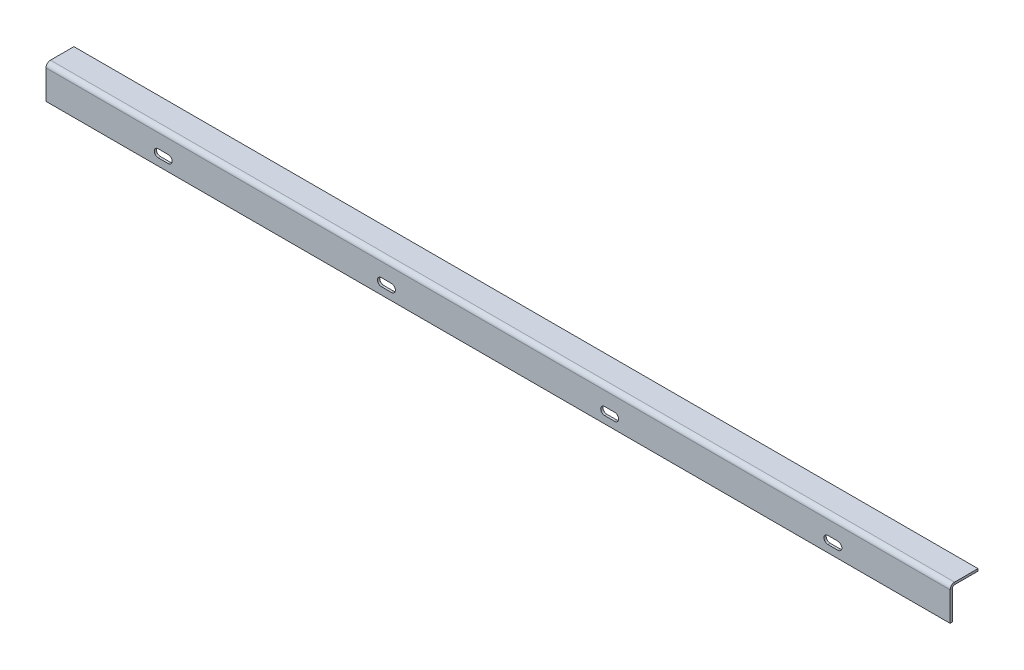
ISO-10303-21;
HEADER;
FILE_DESCRIPTION(('STEP AP214'),'2;1');
FILE_NAME('part.step','',(''),(''),'','','');
FILE_SCHEMA(('AUTOMOTIVE_DESIGN { 1 0 10303 214 1 1 1 1 }'));
ENDSEC;
DATA;
#1=APPLICATION_CONTEXT('core data for automotive mechanical design processes');
#2=APPLICATION_PROTOCOL_DEFINITION('international standard','automotive_design',2000,#1);
#3=PRODUCT_CONTEXT('',#1,'mechanical');
#4=PRODUCT('Part','Part','',(#3));
#5=PRODUCT_RELATED_PRODUCT_CATEGORY('part','',(#4));
#6=PRODUCT_DEFINITION_FORMATION('','',#4);
#7=PRODUCT_DEFINITION_CONTEXT('part definition',#1,'design');
#8=PRODUCT_DEFINITION('design','',#6,#7);
#9=PRODUCT_DEFINITION_SHAPE('','',#8);
#10=(LENGTH_UNIT() NAMED_UNIT(*) SI_UNIT(.MILLI.,.METRE.));
#11=(NAMED_UNIT(*) PLANE_ANGLE_UNIT() SI_UNIT($,.RADIAN.));
#12=(NAMED_UNIT(*) SI_UNIT($,.STERADIAN.) SOLID_ANGLE_UNIT());
#13=UNCERTAINTY_MEASURE_WITH_UNIT(LENGTH_MEASURE(1.E-05),#10,'distance_accuracy_value','');
#14=(GEOMETRIC_REPRESENTATION_CONTEXT(3) GLOBAL_UNCERTAINTY_ASSIGNED_CONTEXT((#13)) GLOBAL_UNIT_ASSIGNED_CONTEXT((#10,
#11,#12)) REPRESENTATION_CONTEXT('',''));
#15=CARTESIAN_POINT('',(0.,0.,0.));
#16=DIRECTION('',(0.,0.,1.));
#17=DIRECTION('',(1.,0.,0.));
#18=AXIS2_PLACEMENT_3D('',#15,#16,#17);
#19=CARTESIAN_POINT('',(-1401.,-47.,0.));
#20=DIRECTION('',(0.,-1.,0.));
#21=DIRECTION('',(0.,0.,-1.));
#22=AXIS2_PLACEMENT_3D('',#19,#20,#21);
#23=PLANE('',#22);
#24=DIRECTION('',(-1.,0.,0.));
#25=VECTOR('',#24,1.);
#26=CARTESIAN_POINT('',(-1401.,-47.,-4.00000000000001));
#27=LINE('',#26,#25);
#28=CARTESIAN_POINT('',(-1401.,-47.,-4.00000000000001));
#29=VERTEX_POINT('',#28);
#30=CARTESIAN_POINT('',(-1419.,-47.,-4.00000000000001));
#31=VERTEX_POINT('',#30);
#32=EDGE_CURVE('E385',#29,#31,#27,.T.);
#33=ORIENTED_EDGE('',*,*,#32,.T.);
#34=DIRECTION('',(0.,0.,-1.));
#35=VECTOR('',#34,1.);
#36=CARTESIAN_POINT('',(-1419.,-47.,0.));
#37=LINE('',#36,#35);
#38=CARTESIAN_POINT('',(-1419.,-47.,0.));
#39=VERTEX_POINT('',#38);
#40=EDGE_CURVE('E11',#39,#31,#37,.T.);
#41=ORIENTED_EDGE('',*,*,#40,.F.);
#42=DIRECTION('',(-1.,0.,0.));
#43=VECTOR('',#42,1.);
#44=CARTESIAN_POINT('',(-1401.,-47.,0.));
#45=LINE('',#44,#43);
#46=CARTESIAN_POINT('',(-1401.,-47.,0.));
#47=VERTEX_POINT('',#46);
#48=EDGE_CURVE('E389',#47,#39,#45,.T.);
#49=ORIENTED_EDGE('',*,*,#48,.F.);
#50=DIRECTION('',(0.,0.,-1.));
#51=VECTOR('',#50,1.);
#52=CARTESIAN_POINT('',(-1401.,-47.,0.));
#53=LINE('',#52,#51);
#54=EDGE_CURVE('E394',#47,#29,#53,.T.);
#55=ORIENTED_EDGE('',*,*,#54,.T.);
#56=EDGE_LOOP('',(#33,#41,#49,#55));
#57=FACE_BOUND('',#56,.T.);
#58=ADVANCED_FACE('F37',(#57),#23,.F.);
#59=CARTESIAN_POINT('',(-1419.,-40.,0.));
#60=DIRECTION('',(0.,0.,-1.));
#61=DIRECTION('',(0.,1.,0.));
#62=AXIS2_PLACEMENT_3D('',#59,#60,#61);
#63=CYLINDRICAL_SURFACE('',#62,7.);
#64=CARTESIAN_POINT('',(-1419.,-40.,-4.00000000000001));
#65=DIRECTION('',(0.,0.,-1.));
#66=DIRECTION('',(0.,1.,0.));
#67=AXIS2_PLACEMENT_3D('',#64,#65,#66);
#68=CIRCLE('',#67,7.);
#69=CARTESIAN_POINT('',(-1419.,-33.,-4.));
#70=VERTEX_POINT('',#69);
#71=EDGE_CURVE('E382',#31,#70,#68,.T.);
#72=ORIENTED_EDGE('',*,*,#71,.T.);
#73=DIRECTION('',(0.,0.,-1.));
#74=VECTOR('',#73,1.);
#75=CARTESIAN_POINT('',(-1419.,-33.,0.));
#76=LINE('',#75,#74);
#77=CARTESIAN_POINT('',(-1419.,-33.,0.));
#78=VERTEX_POINT('',#77);
#79=EDGE_CURVE('E44',#78,#70,#76,.T.);
#80=ORIENTED_EDGE('',*,*,#79,.F.);
#81=CARTESIAN_POINT('',(-1419.,-40.,0.));
#82=DIRECTION('',(0.,0.,-1.));
#83=DIRECTION('',(0.,1.,0.));
#84=AXIS2_PLACEMENT_3D('',#81,#82,#83);
#85=CIRCLE('',#84,7.);
#86=EDGE_CURVE('E58',#39,#78,#85,.T.);
#87=ORIENTED_EDGE('',*,*,#86,.F.);
#88=ORIENTED_EDGE('',*,*,#40,.T.);
#89=EDGE_LOOP('',(#72,#80,#87,#88));
#90=FACE_BOUND('',#89,.T.);
#91=ADVANCED_FACE('F404',(#90),#63,.F.);
#92=CARTESIAN_POINT('',(-1401.,-33.,0.));
#93=DIRECTION('',(0.,1.,0.));
#94=DIRECTION('',(0.,0.,1.));
#95=AXIS2_PLACEMENT_3D('',#92,#93,#94);
#96=PLANE('',#95);
#97=DIRECTION('',(1.,0.,0.));
#98=VECTOR('',#97,1.);
#99=CARTESIAN_POINT('',(-1401.,-33.,-4.));
#100=LINE('',#99,#98);
#101=CARTESIAN_POINT('',(-1401.,-33.,-4.));
#102=VERTEX_POINT('',#101);
#103=EDGE_CURVE('E379',#70,#102,#100,.T.);
#104=ORIENTED_EDGE('',*,*,#103,.T.);
#105=DIRECTION('',(0.,0.,-1.));
#106=VECTOR('',#105,1.);
#107=CARTESIAN_POINT('',(-1401.,-33.,0.));
#108=LINE('',#107,#106);
#109=CARTESIAN_POINT('',(-1401.,-33.,0.));
#110=VERTEX_POINT('',#109);
#111=EDGE_CURVE('E397',#110,#102,#108,.T.);
#112=ORIENTED_EDGE('',*,*,#111,.F.);
#113=DIRECTION('',(1.,0.,0.));
#114=VECTOR('',#113,1.);
#115=CARTESIAN_POINT('',(-1401.,-33.,0.));
#116=LINE('',#115,#114);
#117=EDGE_CURVE('E392',#78,#110,#116,.T.);
#118=ORIENTED_EDGE('',*,*,#117,.F.);
#119=ORIENTED_EDGE('',*,*,#79,.T.);
#120=EDGE_LOOP('',(#104,#112,#118,#119));
#121=FACE_BOUND('',#120,.T.);
#122=ADVANCED_FACE('F401',(#121),#96,.F.);
#123=CARTESIAN_POINT('',(-1401.,-40.,0.));
#124=DIRECTION('',(0.,0.,-1.));
#125=DIRECTION('',(0.,1.,0.));
#126=AXIS2_PLACEMENT_3D('',#123,#124,#125);
#127=CYLINDRICAL_SURFACE('',#126,7.);
#128=CARTESIAN_POINT('',(-1401.,-40.,-4.00000000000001));
#129=DIRECTION('',(0.,0.,-1.));
#130=DIRECTION('',(0.,1.,0.));
#131=AXIS2_PLACEMENT_3D('',#128,#129,#130);
#132=CIRCLE('',#131,7.);
#133=EDGE_CURVE('E377',#102,#29,#132,.T.);
#134=ORIENTED_EDGE('',*,*,#133,.T.);
#135=ORIENTED_EDGE('',*,*,#54,.F.);
#136=CARTESIAN_POINT('',(-1401.,-40.,0.));
#137=DIRECTION('',(0.,0.,-1.));
#138=DIRECTION('',(0.,1.,0.));
#139=AXIS2_PLACEMENT_3D('',#136,#137,#138);
#140=CIRCLE('',#139,7.);
#141=EDGE_CURVE('E51',#110,#47,#140,.T.);
#142=ORIENTED_EDGE('',*,*,#141,.F.);
#143=ORIENTED_EDGE('',*,*,#111,.T.);
#144=EDGE_LOOP('',(#134,#135,#142,#143));
#145=FACE_BOUND('',#144,.T.);
#146=ADVANCED_FACE('F410',(#145),#127,.F.);
#147=CARTESIAN_POINT('',(-1001.,-47.,0.));
#148=DIRECTION('',(0.,-1.,0.));
#149=DIRECTION('',(0.,0.,-1.));
#150=AXIS2_PLACEMENT_3D('',#147,#148,#149);
#151=PLANE('',#150);
#152=DIRECTION('',(-1.,0.,0.));
#153=VECTOR('',#152,1.);
#154=CARTESIAN_POINT('',(-1001.,-47.,-4.00000000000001));
#155=LINE('',#154,#153);
#156=CARTESIAN_POINT('',(-1001.,-47.,-4.00000000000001));
#157=VERTEX_POINT('',#156);
#158=CARTESIAN_POINT('',(-1019.,-47.,-4.00000000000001));
#159=VERTEX_POINT('',#158);
#160=EDGE_CURVE('E353',#157,#159,#155,.T.);
#161=ORIENTED_EDGE('',*,*,#160,.T.);
#162=DIRECTION('',(0.,0.,-1.));
#163=VECTOR('',#162,1.);
#164=CARTESIAN_POINT('',(-1019.,-47.,0.));
#165=LINE('',#164,#163);
#166=CARTESIAN_POINT('',(-1019.,-47.,0.));
#167=VERTEX_POINT('',#166);
#168=EDGE_CURVE('E374',#167,#159,#165,.T.);
#169=ORIENTED_EDGE('',*,*,#168,.F.);
#170=DIRECTION('',(-1.,0.,0.));
#171=VECTOR('',#170,1.);
#172=CARTESIAN_POINT('',(-1001.,-47.,0.));
#173=LINE('',#172,#171);
#174=CARTESIAN_POINT('',(-1001.,-47.,0.));
#175=VERTEX_POINT('',#174);
#176=EDGE_CURVE('E358',#175,#167,#173,.T.);
#177=ORIENTED_EDGE('',*,*,#176,.F.);
#178=DIRECTION('',(0.,0.,-1.));
#179=VECTOR('',#178,1.);
#180=CARTESIAN_POINT('',(-1001.,-47.,0.));
#181=LINE('',#180,#179);
#182=EDGE_CURVE('E365',#175,#157,#181,.T.);
#183=ORIENTED_EDGE('',*,*,#182,.T.);
#184=EDGE_LOOP('',(#161,#169,#177,#183));
#185=FACE_BOUND('',#184,.T.);
#186=ADVANCED_FACE('F412',(#185),#151,.F.);
#187=CARTESIAN_POINT('',(-1019.,-40.,0.));
#188=DIRECTION('',(0.,0.,-1.));
#189=DIRECTION('',(0.,1.,0.));
#190=AXIS2_PLACEMENT_3D('',#187,#188,#189);
#191=CYLINDRICAL_SURFACE('',#190,7.);
#192=CARTESIAN_POINT('',(-1019.,-40.,-4.00000000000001));
#193=DIRECTION('',(0.,0.,-1.));
#194=DIRECTION('',(0.,1.,0.));
#195=AXIS2_PLACEMENT_3D('',#192,#193,#194);
#196=CIRCLE('',#195,7.);
#197=CARTESIAN_POINT('',(-1019.,-33.,-4.));
#198=VERTEX_POINT('',#197);
#199=EDGE_CURVE('E350',#159,#198,#196,.T.);
#200=ORIENTED_EDGE('',*,*,#199,.T.);
#201=DIRECTION('',(0.,0.,-1.));
#202=VECTOR('',#201,1.);
#203=CARTESIAN_POINT('',(-1019.,-33.,0.));
#204=LINE('',#203,#202);
#205=CARTESIAN_POINT('',(-1019.,-33.,0.));
#206=VERTEX_POINT('',#205);
#207=EDGE_CURVE('E371',#206,#198,#204,.T.);
#208=ORIENTED_EDGE('',*,*,#207,.F.);
#209=CARTESIAN_POINT('',(-1019.,-40.,0.));
#210=DIRECTION('',(0.,0.,-1.));
#211=DIRECTION('',(0.,1.,0.));
#212=AXIS2_PLACEMENT_3D('',#209,#210,#211);
#213=CIRCLE('',#212,7.);
#214=EDGE_CURVE('E360',#167,#206,#213,.T.);
#215=ORIENTED_EDGE('',*,*,#214,.F.);
#216=ORIENTED_EDGE('',*,*,#168,.T.);
#217=EDGE_LOOP('',(#200,#208,#215,#216));
#218=FACE_BOUND('',#217,.T.);
#219=ADVANCED_FACE('F418',(#218),#191,.F.);
#220=CARTESIAN_POINT('',(-1001.,-33.,0.));
#221=DIRECTION('',(0.,1.,0.));
#222=DIRECTION('',(0.,0.,1.));
#223=AXIS2_PLACEMENT_3D('',#220,#221,#222);
#224=PLANE('',#223);
#225=DIRECTION('',(1.,0.,0.));
#226=VECTOR('',#225,1.);
#227=CARTESIAN_POINT('',(-1001.,-33.,-4.));
#228=LINE('',#227,#226);
#229=CARTESIAN_POINT('',(-1001.,-33.,-4.));
#230=VERTEX_POINT('',#229);
#231=EDGE_CURVE('E347',#198,#230,#228,.T.);
#232=ORIENTED_EDGE('',*,*,#231,.T.);
#233=DIRECTION('',(0.,0.,-1.));
#234=VECTOR('',#233,1.);
#235=CARTESIAN_POINT('',(-1001.,-33.,0.));
#236=LINE('',#235,#234);
#237=CARTESIAN_POINT('',(-1001.,-33.,0.));
#238=VERTEX_POINT('',#237);
#239=EDGE_CURVE('E368',#238,#230,#236,.T.);
#240=ORIENTED_EDGE('',*,*,#239,.F.);
#241=DIRECTION('',(1.,0.,0.));
#242=VECTOR('',#241,1.);
#243=CARTESIAN_POINT('',(-1001.,-33.,0.));
#244=LINE('',#243,#242);
#245=EDGE_CURVE('E362',#206,#238,#244,.T.);
#246=ORIENTED_EDGE('',*,*,#245,.F.);
#247=ORIENTED_EDGE('',*,*,#207,.T.);
#248=EDGE_LOOP('',(#232,#240,#246,#247));
#249=FACE_BOUND('',#248,.T.);
#250=ADVANCED_FACE('F454',(#249),#224,.F.);
#251=CARTESIAN_POINT('',(-1001.,-40.,0.));
#252=DIRECTION('',(0.,0.,-1.));
#253=DIRECTION('',(0.,1.,0.));
#254=AXIS2_PLACEMENT_3D('',#251,#252,#253);
#255=CYLINDRICAL_SURFACE('',#254,7.);
#256=CARTESIAN_POINT('',(-1001.,-40.,-4.00000000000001));
#257=DIRECTION('',(0.,0.,-1.));
#258=DIRECTION('',(0.,1.,0.));
#259=AXIS2_PLACEMENT_3D('',#256,#257,#258);
#260=CIRCLE('',#259,7.);
#261=EDGE_CURVE('E345',#230,#157,#260,.T.);
#262=ORIENTED_EDGE('',*,*,#261,.T.);
#263=ORIENTED_EDGE('',*,*,#182,.F.);
#264=CARTESIAN_POINT('',(-1001.,-40.,0.));
#265=DIRECTION('',(0.,0.,-1.));
#266=DIRECTION('',(0.,1.,0.));
#267=AXIS2_PLACEMENT_3D('',#264,#265,#266);
#268=CIRCLE('',#267,7.);
#269=EDGE_CURVE('E356',#238,#175,#268,.T.);
#270=ORIENTED_EDGE('',*,*,#269,.F.);
#271=ORIENTED_EDGE('',*,*,#239,.T.);
#272=EDGE_LOOP('',(#262,#263,#270,#271));
#273=FACE_BOUND('',#272,.T.);
#274=ADVANCED_FACE('F465',(#273),#255,.F.);
#275=CARTESIAN_POINT('',(-1620.,-8.,0.));
#276=DIRECTION('',(-1.,0.,0.));
#277=DIRECTION('',(0.,0.,1.));
#278=AXIS2_PLACEMENT_3D('',#275,#276,#277);
#279=PLANE('',#278);
#280=DIRECTION('',(0.,0.,-1.));
#281=VECTOR('',#280,1.);
#282=CARTESIAN_POINT('',(-1620.,-8.,0.));
#283=LINE('',#282,#281);
#284=CARTESIAN_POINT('',(-1620.,-8.,0.));
#285=VERTEX_POINT('',#284);
#286=CARTESIAN_POINT('',(-1620.,-8.,-4.));
#287=VERTEX_POINT('',#286);
#288=EDGE_CURVE('E343',#285,#287,#283,.T.);
#289=ORIENTED_EDGE('',*,*,#288,.F.);
#290=CARTESIAN_POINT('',(-1620.,-8.,-8.));
#291=DIRECTION('',(1.,0.,0.));
#292=DIRECTION('',(0.,0.,-1.));
#293=AXIS2_PLACEMENT_3D('',#290,#291,#292);
#294=CIRCLE('',#293,8.);
#295=CARTESIAN_POINT('',(-1620.,0.,-8.));
#296=VERTEX_POINT('',#295);
#297=EDGE_CURVE('E281',#285,#296,#294,.F.);
#298=ORIENTED_EDGE('',*,*,#297,.T.);
#299=DIRECTION('',(0.,1.,0.));
#300=VECTOR('',#299,1.);
#301=CARTESIAN_POINT('',(-1620.,-4.,-8.));
#302=LINE('',#301,#300);
#303=CARTESIAN_POINT('',(-1620.,-4.,-8.));
#304=VERTEX_POINT('',#303);
#305=EDGE_CURVE('E341',#304,#296,#302,.T.);
#306=ORIENTED_EDGE('',*,*,#305,.F.);
#307=CARTESIAN_POINT('',(-1620.,-8.,-8.));
#308=DIRECTION('',(1.,0.,0.));
#309=DIRECTION('',(0.,0.,-1.));
#310=AXIS2_PLACEMENT_3D('',#307,#308,#309);
#311=CIRCLE('',#310,4.);
#312=EDGE_CURVE('E292',#287,#304,#311,.F.);
#313=ORIENTED_EDGE('',*,*,#312,.F.);
#314=EDGE_LOOP('',(#289,#298,#306,#313));
#315=FACE_BOUND('',#314,.T.);
#316=ADVANCED_FACE('F476',(#315),#279,.T.);
#317=CARTESIAN_POINT('',(-1620.,-4.,-8.));
#318=DIRECTION('',(-1.,0.,0.));
#319=DIRECTION('',(0.,0.,1.));
#320=AXIS2_PLACEMENT_3D('',#317,#318,#319);
#321=PLANE('',#320);
#322=DIRECTION('',(0.,1.,0.));
#323=VECTOR('',#322,1.);
#324=CARTESIAN_POINT('',(-1620.,0.,0.));
#325=LINE('',#324,#323);
#326=CARTESIAN_POINT('',(-1620.,-60.,0.));
#327=VERTEX_POINT('',#326);
#328=EDGE_CURVE('E284',#327,#285,#325,.T.);
#329=ORIENTED_EDGE('',*,*,#328,.T.);
#330=ORIENTED_EDGE('',*,*,#288,.T.);
#331=DIRECTION('',(0.,1.,0.));
#332=VECTOR('',#331,1.);
#333=CARTESIAN_POINT('',(-1620.,0.,-4.));
#334=LINE('',#333,#332);
#335=CARTESIAN_POINT('',(-1620.,-60.,-4.00000000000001));
#336=VERTEX_POINT('',#335);
#337=EDGE_CURVE('E289',#336,#287,#334,.T.);
#338=ORIENTED_EDGE('',*,*,#337,.F.);
#339=DIRECTION('',(0.,0.,1.));
#340=VECTOR('',#339,1.);
#341=CARTESIAN_POINT('',(-1620.,-60.,-4.00000000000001));
#342=LINE('',#341,#340);
#343=EDGE_CURVE('E287',#336,#327,#342,.T.);
#344=ORIENTED_EDGE('',*,*,#343,.T.);
#345=EDGE_LOOP('',(#329,#330,#338,#344));
#346=FACE_BOUND('',#345,.T.);
#347=ADVANCED_FACE('F712',(#346),#321,.T.);
#348=CARTESIAN_POINT('',(0.,0.,-8.));
#349=DIRECTION('',(1.,0.,0.));
#350=DIRECTION('',(0.,0.,-1.));
#351=AXIS2_PLACEMENT_3D('',#348,#349,#350);
#352=PLANE('',#351);
#353=DIRECTION('',(0.,-1.,0.));
#354=VECTOR('',#353,1.);
#355=CARTESIAN_POINT('',(0.,0.,-8.));
#356=LINE('',#355,#354);
#357=CARTESIAN_POINT('',(0.,0.,-8.));
#358=VERTEX_POINT('',#357);
#359=CARTESIAN_POINT('',(0.,-4.,-8.));
#360=VERTEX_POINT('',#359);
#361=EDGE_CURVE('E339',#358,#360,#356,.T.);
#362=ORIENTED_EDGE('',*,*,#361,.F.);
#363=CARTESIAN_POINT('',(0.,-8.,-8.));
#364=DIRECTION('',(1.,0.,0.));
#365=DIRECTION('',(0.,0.,-1.));
#366=AXIS2_PLACEMENT_3D('',#363,#364,#365);
#367=CIRCLE('',#366,8.);
#368=CARTESIAN_POINT('',(0.,-8.,0.));
#369=VERTEX_POINT('',#368);
#370=EDGE_CURVE('E303',#369,#358,#367,.F.);
#371=ORIENTED_EDGE('',*,*,#370,.F.);
#372=DIRECTION('',(0.,0.,1.));
#373=VECTOR('',#372,1.);
#374=CARTESIAN_POINT('',(0.,-8.,-4.));
#375=LINE('',#374,#373);
#376=CARTESIAN_POINT('',(0.,-8.,-4.));
#377=VERTEX_POINT('',#376);
#378=EDGE_CURVE('E319',#377,#369,#375,.T.);
#379=ORIENTED_EDGE('',*,*,#378,.F.);
#380=CARTESIAN_POINT('',(0.,-8.,-8.));
#381=DIRECTION('',(1.,0.,0.));
#382=DIRECTION('',(0.,0.,-1.));
#383=AXIS2_PLACEMENT_3D('',#380,#381,#382);
#384=CIRCLE('',#383,4.);
#385=EDGE_CURVE('E277',#377,#360,#384,.F.);
#386=ORIENTED_EDGE('',*,*,#385,.T.);
#387=EDGE_LOOP('',(#362,#371,#379,#386));
#388=FACE_BOUND('',#387,.T.);
#389=ADVANCED_FACE('F701',(#388),#352,.T.);
#390=CARTESIAN_POINT('',(0.,-8.,-4.));
#391=DIRECTION('',(1.,0.,0.));
#392=DIRECTION('',(0.,0.,-1.));
#393=AXIS2_PLACEMENT_3D('',#390,#391,#392);
#394=PLANE('',#393);
#395=DIRECTION('',(0.,0.,-1.));
#396=VECTOR('',#395,1.);
#397=CARTESIAN_POINT('',(0.,0.,0.));
#398=LINE('',#397,#396);
#399=CARTESIAN_POINT('',(0.,0.,-50.));
#400=VERTEX_POINT('',#399);
#401=EDGE_CURVE('E301',#358,#400,#398,.T.);
#402=ORIENTED_EDGE('',*,*,#401,.F.);
#403=ORIENTED_EDGE('',*,*,#361,.T.);
#404=DIRECTION('',(0.,0.,-1.));
#405=VECTOR('',#404,1.);
#406=CARTESIAN_POINT('',(0.,-4.,0.));
#407=LINE('',#406,#405);
#408=CARTESIAN_POINT('',(0.,-4.,-50.));
#409=VERTEX_POINT('',#408);
#410=EDGE_CURVE('E266',#360,#409,#407,.T.);
#411=ORIENTED_EDGE('',*,*,#410,.T.);
#412=DIRECTION('',(0.,-1.,0.));
#413=VECTOR('',#412,1.);
#414=CARTESIAN_POINT('',(0.,0.,-50.));
#415=LINE('',#414,#413);
#416=EDGE_CURVE('E298',#400,#409,#415,.T.);
#417=ORIENTED_EDGE('',*,*,#416,.F.);
#418=EDGE_LOOP('',(#402,#403,#411,#417));
#419=FACE_BOUND('',#418,.T.);
#420=ADVANCED_FACE('F690',(#419),#394,.T.);
#421=CARTESIAN_POINT('',(-1620.,-4.,0.));
#422=DIRECTION('',(0.,-1.,0.));
#423=DIRECTION('',(0.,0.,-1.));
#424=AXIS2_PLACEMENT_3D('',#421,#422,#423);
#425=PLANE('',#424);
#426=ORIENTED_EDGE('',*,*,#410,.F.);
#427=DIRECTION('',(1.,0.,0.));
#428=VECTOR('',#427,1.);
#429=CARTESIAN_POINT('',(-1620.,-4.,-8.));
#430=LINE('',#429,#428);
#431=EDGE_CURVE('E316',#304,#360,#430,.T.);
#432=ORIENTED_EDGE('',*,*,#431,.F.);
#433=DIRECTION('',(0.,0.,-1.));
#434=VECTOR('',#433,1.);
#435=CARTESIAN_POINT('',(-1620.,-4.,0.));
#436=LINE('',#435,#434);
#437=CARTESIAN_POINT('',(-1620.,-4.,-50.));
#438=VERTEX_POINT('',#437);
#439=EDGE_CURVE('E273',#304,#438,#436,.T.);
#440=ORIENTED_EDGE('',*,*,#439,.T.);
#441=DIRECTION('',(1.,0.,0.));
#442=VECTOR('',#441,1.);
#443=CARTESIAN_POINT('',(-1620.,-4.,-50.));
#444=LINE('',#443,#442);
#445=EDGE_CURVE('E295',#438,#409,#444,.T.);
#446=ORIENTED_EDGE('',*,*,#445,.T.);
#447=EDGE_LOOP('',(#426,#432,#440,#446));
#448=FACE_BOUND('',#447,.T.);
#449=ADVANCED_FACE('F680',(#448),#425,.T.);
#450=CARTESIAN_POINT('',(-1620.,-8.,-8.));
#451=DIRECTION('',(1.,0.,0.));
#452=DIRECTION('',(0.,0.,-1.));
#453=AXIS2_PLACEMENT_3D('',#450,#451,#452);
#454=CYLINDRICAL_SURFACE('',#453,4.);
#455=ORIENTED_EDGE('',*,*,#385,.F.);
#456=DIRECTION('',(1.,0.,0.));
#457=VECTOR('',#456,1.);
#458=CARTESIAN_POINT('',(-1620.,-8.,-4.));
#459=LINE('',#458,#457);
#460=EDGE_CURVE('E320',#287,#377,#459,.T.);
#461=ORIENTED_EDGE('',*,*,#460,.F.);
#462=ORIENTED_EDGE('',*,*,#312,.T.);
#463=ORIENTED_EDGE('',*,*,#431,.T.);
#464=EDGE_LOOP('',(#455,#461,#462,#463));
#465=FACE_BOUND('',#464,.T.);
#466=ADVANCED_FACE('F490',(#465),#454,.F.);
#467=CARTESIAN_POINT('',(-1620.,0.,-4.));
#468=DIRECTION('',(0.,0.,-1.));
#469=DIRECTION('',(0.,1.,0.));
#470=AXIS2_PLACEMENT_3D('',#467,#468,#469);
#471=PLANE('',#470);
#472=CARTESIAN_POINT('',(-601.,-40.,-4.00000000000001));
#473=DIRECTION('',(0.,0.,-1.));
#474=DIRECTION('',(0.,1.,0.));
#475=AXIS2_PLACEMENT_3D('',#472,#473,#474);
#476=CIRCLE('',#475,7.);
#477=CARTESIAN_POINT('',(-601.,-33.,-4.));
#478=VERTEX_POINT('',#477);
#479=CARTESIAN_POINT('',(-601.,-47.,-4.00000000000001));
#480=VERTEX_POINT('',#479);
#481=EDGE_CURVE('E235',#478,#480,#476,.T.);
#482=ORIENTED_EDGE('',*,*,#481,.F.);
#483=DIRECTION('',(1.,0.,0.));
#484=VECTOR('',#483,1.);
#485=CARTESIAN_POINT('',(-601.,-33.,-4.));
#486=LINE('',#485,#484);
#487=CARTESIAN_POINT('',(-619.,-33.,-4.));
#488=VERTEX_POINT('',#487);
#489=EDGE_CURVE('E221',#488,#478,#486,.T.);
#490=ORIENTED_EDGE('',*,*,#489,.F.);
#491=CARTESIAN_POINT('',(-619.,-40.,-4.00000000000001));
#492=DIRECTION('',(0.,0.,-1.));
#493=DIRECTION('',(0.,1.,0.));
#494=AXIS2_PLACEMENT_3D('',#491,#492,#493);
#495=CIRCLE('',#494,7.);
#496=CARTESIAN_POINT('',(-619.,-47.,-4.00000000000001));
#497=VERTEX_POINT('',#496);
#498=EDGE_CURVE('E213',#497,#488,#495,.T.);
#499=ORIENTED_EDGE('',*,*,#498,.F.);
#500=DIRECTION('',(-1.,0.,0.));
#501=VECTOR('',#500,1.);
#502=CARTESIAN_POINT('',(-601.,-47.,-4.00000000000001));
#503=LINE('',#502,#501);
#504=EDGE_CURVE('E199',#480,#497,#503,.T.);
#505=ORIENTED_EDGE('',*,*,#504,.F.);
#506=EDGE_LOOP('',(#482,#490,#499,#505));
#507=FACE_BOUND('',#506,.T.);
#508=CARTESIAN_POINT('',(-201.,-40.,-4.00000000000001));
#509=DIRECTION('',(0.,0.,-1.));
#510=DIRECTION('',(0.,1.,0.));
#511=AXIS2_PLACEMENT_3D('',#508,#509,#510);
#512=CIRCLE('',#511,7.);
#513=CARTESIAN_POINT('',(-201.,-33.,-4.));
#514=VERTEX_POINT('',#513);
#515=CARTESIAN_POINT('',(-201.,-47.,-4.00000000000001));
#516=VERTEX_POINT('',#515);
#517=EDGE_CURVE('E240',#514,#516,#512,.T.);
#518=ORIENTED_EDGE('',*,*,#517,.F.);
#519=DIRECTION('',(1.,0.,0.));
#520=VECTOR('',#519,1.);
#521=CARTESIAN_POINT('',(-201.,-33.,-4.));
#522=LINE('',#521,#520);
#523=CARTESIAN_POINT('',(-219.,-33.,-4.));
#524=VERTEX_POINT('',#523);
#525=EDGE_CURVE('E245',#524,#514,#522,.T.);
#526=ORIENTED_EDGE('',*,*,#525,.F.);
#527=CARTESIAN_POINT('',(-219.,-40.,-4.00000000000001));
#528=DIRECTION('',(0.,0.,-1.));
#529=DIRECTION('',(0.,1.,0.));
#530=AXIS2_PLACEMENT_3D('',#527,#528,#529);
#531=CIRCLE('',#530,7.);
#532=CARTESIAN_POINT('',(-219.,-47.,-4.00000000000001));
#533=VERTEX_POINT('',#532);
#534=EDGE_CURVE('E259',#533,#524,#531,.T.);
#535=ORIENTED_EDGE('',*,*,#534,.F.);
#536=DIRECTION('',(-1.,0.,0.));
#537=VECTOR('',#536,1.);
#538=CARTESIAN_POINT('',(-201.,-47.,-4.00000000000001));
#539=LINE('',#538,#537);
#540=EDGE_CURVE('E256',#516,#533,#539,.T.);
#541=ORIENTED_EDGE('',*,*,#540,.F.);
#542=EDGE_LOOP('',(#518,#526,#535,#541));
#543=FACE_BOUND('',#542,.T.);
#544=DIRECTION('',(0.,1.,0.));
#545=VECTOR('',#544,1.);
#546=CARTESIAN_POINT('',(0.,0.,-4.));
#547=LINE('',#546,#545);
#548=CARTESIAN_POINT('',(0.,-60.,-4.00000000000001));
#549=VERTEX_POINT('',#548);
#550=EDGE_CURVE('E311',#549,#377,#547,.T.);
#551=ORIENTED_EDGE('',*,*,#550,.F.);
#552=DIRECTION('',(1.,0.,0.));
#553=VECTOR('',#552,1.);
#554=CARTESIAN_POINT('',(-1620.,-60.,-4.00000000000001));
#555=LINE('',#554,#553);
#556=EDGE_CURVE('E323',#336,#549,#555,.T.);
#557=ORIENTED_EDGE('',*,*,#556,.F.);
#558=ORIENTED_EDGE('',*,*,#337,.T.);
#559=ORIENTED_EDGE('',*,*,#460,.T.);
#560=EDGE_LOOP('',(#551,#557,#558,#559));
#561=FACE_BOUND('',#560,.T.);
#562=ORIENTED_EDGE('',*,*,#261,.F.);
#563=ORIENTED_EDGE('',*,*,#231,.F.);
#564=ORIENTED_EDGE('',*,*,#199,.F.);
#565=ORIENTED_EDGE('',*,*,#160,.F.);
#566=EDGE_LOOP('',(#562,#563,#564,#565));
#567=FACE_BOUND('',#566,.T.);
#568=ORIENTED_EDGE('',*,*,#133,.F.);
#569=ORIENTED_EDGE('',*,*,#103,.F.);
#570=ORIENTED_EDGE('',*,*,#71,.F.);
#571=ORIENTED_EDGE('',*,*,#32,.F.);
#572=EDGE_LOOP('',(#568,#569,#570,#571));
#573=FACE_BOUND('',#572,.T.);
#574=ADVANCED_FACE('F219',(#507,#543,#561,#567,#573),#471,.T.);
#575=CARTESIAN_POINT('',(-1620.,-60.,-4.00000000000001));
#576=DIRECTION('',(0.,1.,0.));
#577=DIRECTION('',(0.,0.,1.));
#578=AXIS2_PLACEMENT_3D('',#575,#576,#577);
#579=PLANE('',#578);
#580=DIRECTION('',(0.,0.,1.));
#581=VECTOR('',#580,1.);
#582=CARTESIAN_POINT('',(0.,-60.,-4.00000000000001));
#583=LINE('',#582,#581);
#584=CARTESIAN_POINT('',(0.,-60.,0.));
#585=VERTEX_POINT('',#584);
#586=EDGE_CURVE('E309',#549,#585,#583,.T.);
#587=ORIENTED_EDGE('',*,*,#586,.T.);
#588=DIRECTION('',(1.,0.,0.));
#589=VECTOR('',#588,1.);
#590=CARTESIAN_POINT('',(-1620.,-60.,0.));
#591=LINE('',#590,#589);
#592=EDGE_CURVE('E325',#327,#585,#591,.T.);
#593=ORIENTED_EDGE('',*,*,#592,.F.);
#594=ORIENTED_EDGE('',*,*,#343,.F.);
#595=ORIENTED_EDGE('',*,*,#556,.T.);
#596=EDGE_LOOP('',(#587,#593,#594,#595));
#597=FACE_BOUND('',#596,.T.);
#598=ADVANCED_FACE('F489',(#597),#579,.F.);
#599=CARTESIAN_POINT('',(-1620.,0.,0.));
#600=DIRECTION('',(0.,0.,-1.));
#601=DIRECTION('',(0.,1.,0.));
#602=AXIS2_PLACEMENT_3D('',#599,#600,#601);
#603=PLANE('',#602);
#604=DIRECTION('',(1.,0.,0.));
#605=VECTOR('',#604,1.);
#606=CARTESIAN_POINT('',(-601.,-33.,0.));
#607=LINE('',#606,#605);
#608=CARTESIAN_POINT('',(-619.,-33.,0.));
#609=VERTEX_POINT('',#608);
#610=CARTESIAN_POINT('',(-601.,-33.,0.));
#611=VERTEX_POINT('',#610);
#612=EDGE_CURVE('E232',#609,#611,#607,.T.);
#613=ORIENTED_EDGE('',*,*,#612,.T.);
#614=CARTESIAN_POINT('',(-601.,-40.,0.));
#615=DIRECTION('',(0.,0.,-1.));
#616=DIRECTION('',(0.,1.,0.));
#617=AXIS2_PLACEMENT_3D('',#614,#615,#616);
#618=CIRCLE('',#617,7.);
#619=CARTESIAN_POINT('',(-601.,-47.,0.));
#620=VERTEX_POINT('',#619);
#621=EDGE_CURVE('E237',#611,#620,#618,.T.);
#622=ORIENTED_EDGE('',*,*,#621,.T.);
#623=DIRECTION('',(-1.,0.,0.));
#624=VECTOR('',#623,1.);
#625=CARTESIAN_POINT('',(-601.,-47.,0.));
#626=LINE('',#625,#624);
#627=CARTESIAN_POINT('',(-619.,-47.,0.));
#628=VERTEX_POINT('',#627);
#629=EDGE_CURVE('E209',#620,#628,#626,.T.);
#630=ORIENTED_EDGE('',*,*,#629,.T.);
#631=CARTESIAN_POINT('',(-619.,-40.,0.));
#632=DIRECTION('',(0.,0.,-1.));
#633=DIRECTION('',(0.,1.,0.));
#634=AXIS2_PLACEMENT_3D('',#631,#632,#633);
#635=CIRCLE('',#634,7.);
#636=EDGE_CURVE('E216',#628,#609,#635,.T.);
#637=ORIENTED_EDGE('',*,*,#636,.T.);
#638=EDGE_LOOP('',(#613,#622,#630,#637));
#639=FACE_BOUND('',#638,.T.);
#640=DIRECTION('',(1.,0.,0.));
#641=VECTOR('',#640,1.);
#642=CARTESIAN_POINT('',(-201.,-33.,0.));
#643=LINE('',#642,#641);
#644=CARTESIAN_POINT('',(-219.,-33.,0.));
#645=VERTEX_POINT('',#644);
#646=CARTESIAN_POINT('',(-201.,-33.,0.));
#647=VERTEX_POINT('',#646);
#648=EDGE_CURVE('E251',#645,#647,#643,.T.);
#649=ORIENTED_EDGE('',*,*,#648,.T.);
#650=CARTESIAN_POINT('',(-201.,-40.,0.));
#651=DIRECTION('',(0.,0.,-1.));
#652=DIRECTION('',(0.,1.,0.));
#653=AXIS2_PLACEMENT_3D('',#650,#651,#652);
#654=CIRCLE('',#653,7.);
#655=CARTESIAN_POINT('',(-201.,-47.,0.));
#656=VERTEX_POINT('',#655);
#657=EDGE_CURVE('E241',#647,#656,#654,.T.);
#658=ORIENTED_EDGE('',*,*,#657,.T.);
#659=DIRECTION('',(-1.,0.,0.));
#660=VECTOR('',#659,1.);
#661=CARTESIAN_POINT('',(-201.,-47.,0.));
#662=LINE('',#661,#660);
#663=CARTESIAN_POINT('',(-219.,-47.,0.));
#664=VERTEX_POINT('',#663);
#665=EDGE_CURVE('E244',#656,#664,#662,.T.);
#666=ORIENTED_EDGE('',*,*,#665,.T.);
#667=CARTESIAN_POINT('',(-219.,-40.,0.));
#668=DIRECTION('',(0.,0.,-1.));
#669=DIRECTION('',(0.,1.,0.));
#670=AXIS2_PLACEMENT_3D('',#667,#668,#669);
#671=CIRCLE('',#670,7.);
#672=EDGE_CURVE('E248',#664,#645,#671,.T.);
#673=ORIENTED_EDGE('',*,*,#672,.T.);
#674=EDGE_LOOP('',(#649,#658,#666,#673));
#675=FACE_BOUND('',#674,.T.);
#676=DIRECTION('',(0.,1.,0.));
#677=VECTOR('',#676,1.);
#678=CARTESIAN_POINT('',(0.,0.,0.));
#679=LINE('',#678,#677);
#680=EDGE_CURVE('E306',#585,#369,#679,.T.);
#681=ORIENTED_EDGE('',*,*,#680,.T.);
#682=DIRECTION('',(1.,0.,0.));
#683=VECTOR('',#682,1.);
#684=CARTESIAN_POINT('',(-1620.,-8.,0.));
#685=LINE('',#684,#683);
#686=EDGE_CURVE('E328',#285,#369,#685,.T.);
#687=ORIENTED_EDGE('',*,*,#686,.F.);
#688=ORIENTED_EDGE('',*,*,#328,.F.);
#689=ORIENTED_EDGE('',*,*,#592,.T.);
#690=EDGE_LOOP('',(#681,#687,#688,#689));
#691=FACE_BOUND('',#690,.T.);
#692=ORIENTED_EDGE('',*,*,#269,.T.);
#693=ORIENTED_EDGE('',*,*,#176,.T.);
#694=ORIENTED_EDGE('',*,*,#214,.T.);
#695=ORIENTED_EDGE('',*,*,#245,.T.);
#696=EDGE_LOOP('',(#692,#693,#694,#695));
#697=FACE_BOUND('',#696,.T.);
#698=ORIENTED_EDGE('',*,*,#141,.T.);
#699=ORIENTED_EDGE('',*,*,#48,.T.);
#700=ORIENTED_EDGE('',*,*,#86,.T.);
#701=ORIENTED_EDGE('',*,*,#117,.T.);
#702=EDGE_LOOP('',(#698,#699,#700,#701));
#703=FACE_BOUND('',#702,.T.);
#704=ADVANCED_FACE('F500',(#639,#675,#691,#697,#703),#603,.F.);
#705=CARTESIAN_POINT('',(-1620.,-8.,-8.));
#706=DIRECTION('',(1.,0.,0.));
#707=DIRECTION('',(0.,0.,-1.));
#708=AXIS2_PLACEMENT_3D('',#705,#706,#707);
#709=CYLINDRICAL_SURFACE('',#708,8.);
#710=ORIENTED_EDGE('',*,*,#370,.T.);
#711=DIRECTION('',(1.,0.,0.));
#712=VECTOR('',#711,1.);
#713=CARTESIAN_POINT('',(-1620.,0.,-8.));
#714=LINE('',#713,#712);
#715=EDGE_CURVE('E331',#296,#358,#714,.T.);
#716=ORIENTED_EDGE('',*,*,#715,.F.);
#717=ORIENTED_EDGE('',*,*,#297,.F.);
#718=ORIENTED_EDGE('',*,*,#686,.T.);
#719=EDGE_LOOP('',(#710,#716,#717,#718));
#720=FACE_BOUND('',#719,.T.);
#721=ADVANCED_FACE('F505',(#720),#709,.T.);
#722=CARTESIAN_POINT('',(-1620.,0.,0.));
#723=DIRECTION('',(0.,-1.,0.));
#724=DIRECTION('',(0.,0.,-1.));
#725=AXIS2_PLACEMENT_3D('',#722,#723,#724);
#726=PLANE('',#725);
#727=ORIENTED_EDGE('',*,*,#401,.T.);
#728=DIRECTION('',(1.,0.,0.));
#729=VECTOR('',#728,1.);
#730=CARTESIAN_POINT('',(-1620.,0.,-50.));
#731=LINE('',#730,#729);
#732=CARTESIAN_POINT('',(-1620.,0.,-50.));
#733=VERTEX_POINT('',#732);
#734=EDGE_CURVE('E334',#733,#400,#731,.T.);
#735=ORIENTED_EDGE('',*,*,#734,.F.);
#736=DIRECTION('',(0.,0.,-1.));
#737=VECTOR('',#736,1.);
#738=CARTESIAN_POINT('',(-1620.,0.,0.));
#739=LINE('',#738,#737);
#740=EDGE_CURVE('E279',#296,#733,#739,.T.);
#741=ORIENTED_EDGE('',*,*,#740,.F.);
#742=ORIENTED_EDGE('',*,*,#715,.T.);
#743=EDGE_LOOP('',(#727,#735,#741,#742));
#744=FACE_BOUND('',#743,.T.);
#745=ADVANCED_FACE('F646',(#744),#726,.F.);
#746=CARTESIAN_POINT('',(-1620.,0.,-50.));
#747=DIRECTION('',(0.,0.,1.));
#748=DIRECTION('',(1.,0.,0.));
#749=AXIS2_PLACEMENT_3D('',#746,#747,#748);
#750=PLANE('',#749);
#751=ORIENTED_EDGE('',*,*,#416,.T.);
#752=ORIENTED_EDGE('',*,*,#445,.F.);
#753=DIRECTION('',(0.,-1.,0.));
#754=VECTOR('',#753,1.);
#755=CARTESIAN_POINT('',(-1620.,0.,-50.));
#756=LINE('',#755,#754);
#757=EDGE_CURVE('E276',#733,#438,#756,.T.);
#758=ORIENTED_EDGE('',*,*,#757,.F.);
#759=ORIENTED_EDGE('',*,*,#734,.T.);
#760=EDGE_LOOP('',(#751,#752,#758,#759));
#761=FACE_BOUND('',#760,.T.);
#762=ADVANCED_FACE('F635',(#761),#750,.F.);
#763=CARTESIAN_POINT('',(-1620.,-8.,-8.));
#764=DIRECTION('',(1.,0.,0.));
#765=DIRECTION('',(0.,0.,-1.));
#766=AXIS2_PLACEMENT_3D('',#763,#764,#765);
#767=PLANE('',#766);
#768=ORIENTED_EDGE('',*,*,#439,.F.);
#769=ORIENTED_EDGE('',*,*,#305,.T.);
#770=ORIENTED_EDGE('',*,*,#740,.T.);
#771=ORIENTED_EDGE('',*,*,#757,.T.);
#772=EDGE_LOOP('',(#768,#769,#770,#771));
#773=FACE_BOUND('',#772,.T.);
#774=ADVANCED_FACE('F623',(#773),#767,.F.);
#775=CARTESIAN_POINT('',(0.,-8.,-8.));
#776=DIRECTION('',(1.,0.,0.));
#777=DIRECTION('',(0.,0.,-1.));
#778=AXIS2_PLACEMENT_3D('',#775,#776,#777);
#779=PLANE('',#778);
#780=ORIENTED_EDGE('',*,*,#550,.T.);
#781=ORIENTED_EDGE('',*,*,#378,.T.);
#782=ORIENTED_EDGE('',*,*,#680,.F.);
#783=ORIENTED_EDGE('',*,*,#586,.F.);
#784=EDGE_LOOP('',(#780,#781,#782,#783));
#785=FACE_BOUND('',#784,.T.);
#786=ADVANCED_FACE('F611',(#785),#779,.T.);
#787=CARTESIAN_POINT('',(-201.,-40.,0.));
#788=DIRECTION('',(0.,0.,-1.));
#789=DIRECTION('',(0.,1.,0.));
#790=AXIS2_PLACEMENT_3D('',#787,#788,#789);
#791=CYLINDRICAL_SURFACE('',#790,7.);
#792=ORIENTED_EDGE('',*,*,#517,.T.);
#793=DIRECTION('',(0.,0.,-1.));
#794=VECTOR('',#793,1.);
#795=CARTESIAN_POINT('',(-201.,-47.,0.));
#796=LINE('',#795,#794);
#797=EDGE_CURVE('E254',#656,#516,#796,.T.);
#798=ORIENTED_EDGE('',*,*,#797,.F.);
#799=ORIENTED_EDGE('',*,*,#657,.F.);
#800=DIRECTION('',(0.,0.,-1.));
#801=VECTOR('',#800,1.);
#802=CARTESIAN_POINT('',(-201.,-33.,0.));
#803=LINE('',#802,#801);
#804=EDGE_CURVE('E264',#647,#514,#803,.T.);
#805=ORIENTED_EDGE('',*,*,#804,.T.);
#806=EDGE_LOOP('',(#792,#798,#799,#805));
#807=FACE_BOUND('',#806,.T.);
#808=ADVANCED_FACE('F600',(#807),#791,.F.);
#809=CARTESIAN_POINT('',(-201.,-33.,0.));
#810=DIRECTION('',(0.,1.,0.));
#811=DIRECTION('',(0.,0.,1.));
#812=AXIS2_PLACEMENT_3D('',#809,#810,#811);
#813=PLANE('',#812);
#814=ORIENTED_EDGE('',*,*,#525,.T.);
#815=ORIENTED_EDGE('',*,*,#804,.F.);
#816=ORIENTED_EDGE('',*,*,#648,.F.);
#817=DIRECTION('',(0.,0.,-1.));
#818=VECTOR('',#817,1.);
#819=CARTESIAN_POINT('',(-219.,-33.,0.));
#820=LINE('',#819,#818);
#821=EDGE_CURVE('E267',#645,#524,#820,.T.);
#822=ORIENTED_EDGE('',*,*,#821,.T.);
#823=EDGE_LOOP('',(#814,#815,#816,#822));
#824=FACE_BOUND('',#823,.T.);
#825=ADVANCED_FACE('F589',(#824),#813,.F.);
#826=CARTESIAN_POINT('',(-219.,-40.,0.));
#827=DIRECTION('',(0.,0.,-1.));
#828=DIRECTION('',(0.,1.,0.));
#829=AXIS2_PLACEMENT_3D('',#826,#827,#828);
#830=CYLINDRICAL_SURFACE('',#829,7.);
#831=ORIENTED_EDGE('',*,*,#534,.T.);
#832=ORIENTED_EDGE('',*,*,#821,.F.);
#833=ORIENTED_EDGE('',*,*,#672,.F.);
#834=DIRECTION('',(0.,0.,-1.));
#835=VECTOR('',#834,1.);
#836=CARTESIAN_POINT('',(-219.,-47.,0.));
#837=LINE('',#836,#835);
#838=EDGE_CURVE('E269',#664,#533,#837,.T.);
#839=ORIENTED_EDGE('',*,*,#838,.T.);
#840=EDGE_LOOP('',(#831,#832,#833,#839));
#841=FACE_BOUND('',#840,.T.);
#842=ADVANCED_FACE('F578',(#841),#830,.F.);
#843=CARTESIAN_POINT('',(-201.,-47.,0.));
#844=DIRECTION('',(0.,-1.,0.));
#845=DIRECTION('',(0.,0.,-1.));
#846=AXIS2_PLACEMENT_3D('',#843,#844,#845);
#847=PLANE('',#846);
#848=ORIENTED_EDGE('',*,*,#540,.T.);
#849=ORIENTED_EDGE('',*,*,#838,.F.);
#850=ORIENTED_EDGE('',*,*,#665,.F.);
#851=ORIENTED_EDGE('',*,*,#797,.T.);
#852=EDGE_LOOP('',(#848,#849,#850,#851));
#853=FACE_BOUND('',#852,.T.);
#854=ADVANCED_FACE('F519',(#853),#847,.F.);
#855=CARTESIAN_POINT('',(-601.,-40.,0.));
#856=DIRECTION('',(0.,0.,-1.));
#857=DIRECTION('',(0.,1.,0.));
#858=AXIS2_PLACEMENT_3D('',#855,#856,#857);
#859=CYLINDRICAL_SURFACE('',#858,7.);
#860=ORIENTED_EDGE('',*,*,#481,.T.);
#861=DIRECTION('',(0.,0.,-1.));
#862=VECTOR('',#861,1.);
#863=CARTESIAN_POINT('',(-601.,-47.,0.));
#864=LINE('',#863,#862);
#865=EDGE_CURVE('E205',#620,#480,#864,.T.);
#866=ORIENTED_EDGE('',*,*,#865,.F.);
#867=ORIENTED_EDGE('',*,*,#621,.F.);
#868=DIRECTION('',(0.,0.,-1.));
#869=VECTOR('',#868,1.);
#870=CARTESIAN_POINT('',(-601.,-33.,0.));
#871=LINE('',#870,#869);
#872=EDGE_CURVE('E229',#611,#478,#871,.T.);
#873=ORIENTED_EDGE('',*,*,#872,.T.);
#874=EDGE_LOOP('',(#860,#866,#867,#873));
#875=FACE_BOUND('',#874,.T.);
#876=ADVANCED_FACE('F514',(#875),#859,.F.);
#877=CARTESIAN_POINT('',(-601.,-33.,0.));
#878=DIRECTION('',(0.,1.,0.));
#879=DIRECTION('',(0.,0.,1.));
#880=AXIS2_PLACEMENT_3D('',#877,#878,#879);
#881=PLANE('',#880);
#882=ORIENTED_EDGE('',*,*,#489,.T.);
#883=ORIENTED_EDGE('',*,*,#872,.F.);
#884=ORIENTED_EDGE('',*,*,#612,.F.);
#885=DIRECTION('',(0.,0.,-1.));
#886=VECTOR('',#885,1.);
#887=CARTESIAN_POINT('',(-619.,-33.,0.));
#888=LINE('',#887,#886);
#889=EDGE_CURVE('E222',#609,#488,#888,.T.);
#890=ORIENTED_EDGE('',*,*,#889,.T.);
#891=EDGE_LOOP('',(#882,#883,#884,#890));
#892=FACE_BOUND('',#891,.T.);
#893=ADVANCED_FACE('F518',(#892),#881,.F.);
#894=CARTESIAN_POINT('',(-619.,-40.,0.));
#895=DIRECTION('',(0.,0.,-1.));
#896=DIRECTION('',(0.,1.,0.));
#897=AXIS2_PLACEMENT_3D('',#894,#895,#896);
#898=CYLINDRICAL_SURFACE('',#897,7.);
#899=ORIENTED_EDGE('',*,*,#498,.T.);
#900=ORIENTED_EDGE('',*,*,#889,.F.);
#901=ORIENTED_EDGE('',*,*,#636,.F.);
#902=DIRECTION('',(0.,0.,-1.));
#903=VECTOR('',#902,1.);
#904=CARTESIAN_POINT('',(-619.,-47.,0.));
#905=LINE('',#904,#903);
#906=EDGE_CURVE('E202',#628,#497,#905,.T.);
#907=ORIENTED_EDGE('',*,*,#906,.T.);
#908=EDGE_LOOP('',(#899,#900,#901,#907));
#909=FACE_BOUND('',#908,.T.);
#910=ADVANCED_FACE('F212',(#909),#898,.F.);
#911=CARTESIAN_POINT('',(-601.,-47.,0.));
#912=DIRECTION('',(0.,-1.,0.));
#913=DIRECTION('',(0.,0.,-1.));
#914=AXIS2_PLACEMENT_3D('',#911,#912,#913);
#915=PLANE('',#914);
#916=ORIENTED_EDGE('',*,*,#504,.T.);
#917=ORIENTED_EDGE('',*,*,#906,.F.);
#918=ORIENTED_EDGE('',*,*,#629,.F.);
#919=ORIENTED_EDGE('',*,*,#865,.T.);
#920=EDGE_LOOP('',(#916,#917,#918,#919));
#921=FACE_BOUND('',#920,.T.);
#922=ADVANCED_FACE('F201',(#921),#915,.F.);
#923=CLOSED_SHELL('',(#58,#91,#122,#146,#186,#219,#250,#274,#316,#347,#389,#420,#449,#466,#574,
#598,#704,#721,#745,#762,#774,#786,#808,#825,#842,#854,#876,#893,#910,#922));
#924=MANIFOLD_SOLID_BREP('B2',#923);
#925=ADVANCED_BREP_SHAPE_REPRESENTATION('',(#18,#924),#14);
#926=SHAPE_DEFINITION_REPRESENTATION(#9,#925);
ENDSEC;
END-ISO-10303-21;
